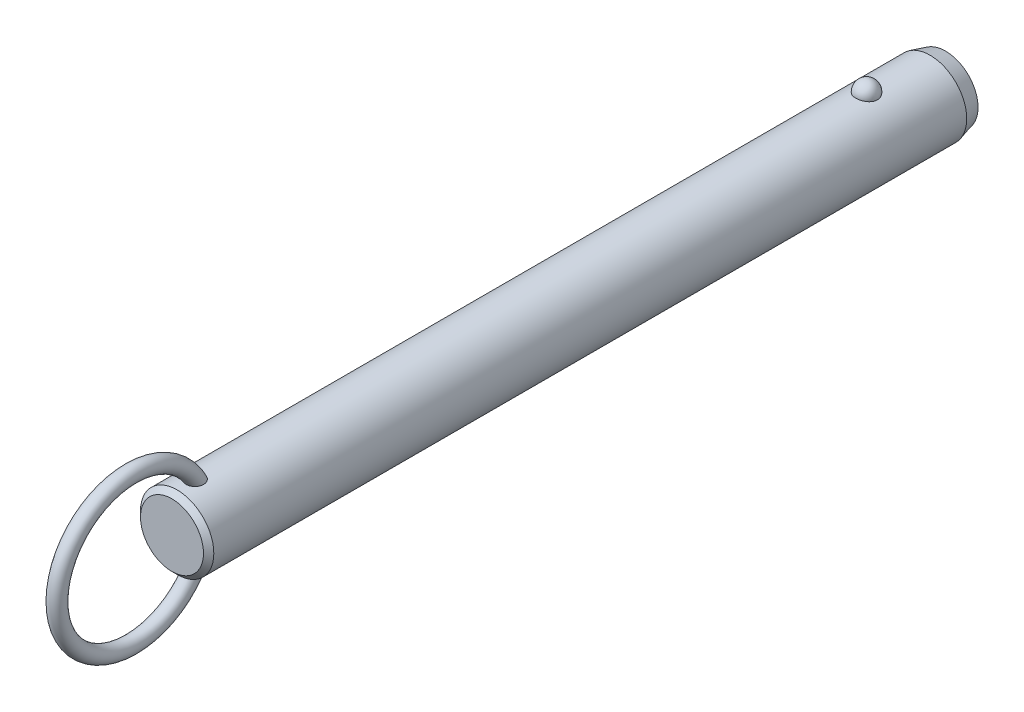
ISO-10303-21;
HEADER;
FILE_DESCRIPTION(('STEP AP214'),'2;1');
FILE_NAME('part.step','',(''),(''),'','','');
FILE_SCHEMA(('AUTOMOTIVE_DESIGN { 1 0 10303 214 1 1 1 1 }'));
ENDSEC;
DATA;
#1=APPLICATION_CONTEXT('core data for automotive mechanical design processes');
#2=APPLICATION_PROTOCOL_DEFINITION('international standard','automotive_design',2000,#1);
#3=PRODUCT_CONTEXT('',#1,'mechanical');
#4=PRODUCT('Part','Part','',(#3));
#5=PRODUCT_RELATED_PRODUCT_CATEGORY('part','',(#4));
#6=PRODUCT_DEFINITION_FORMATION('','',#4);
#7=PRODUCT_DEFINITION_CONTEXT('part definition',#1,'design');
#8=PRODUCT_DEFINITION('design','',#6,#7);
#9=PRODUCT_DEFINITION_SHAPE('','',#8);
#10=(LENGTH_UNIT() NAMED_UNIT(*) SI_UNIT(.MILLI.,.METRE.));
#11=(NAMED_UNIT(*) PLANE_ANGLE_UNIT() SI_UNIT($,.RADIAN.));
#12=(NAMED_UNIT(*) SI_UNIT($,.STERADIAN.) SOLID_ANGLE_UNIT());
#13=UNCERTAINTY_MEASURE_WITH_UNIT(LENGTH_MEASURE(1.E-05),#10,'distance_accuracy_value','');
#14=(GEOMETRIC_REPRESENTATION_CONTEXT(3) GLOBAL_UNCERTAINTY_ASSIGNED_CONTEXT((#13)) GLOBAL_UNIT_ASSIGNED_CONTEXT((#10,
#11,#12)) REPRESENTATION_CONTEXT('',''));
#15=CARTESIAN_POINT('',(0.,0.,0.));
#16=DIRECTION('',(0.,0.,1.));
#17=DIRECTION('',(1.,0.,0.));
#18=AXIS2_PLACEMENT_3D('',#15,#16,#17);
#19=CARTESIAN_POINT('',(0.,0.,124.5));
#20=DIRECTION('',(0.,0.,-1.));
#21=DIRECTION('',(-1.,0.,0.));
#22=AXIS2_PLACEMENT_3D('',#19,#20,#21);
#23=CYLINDRICAL_SURFACE('',#22,7.1);
#24=CARTESIAN_POINT('',(2.0769088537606,6.78943661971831,-2.1));
#25=CARTESIAN_POINT('',(2.07690739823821,6.78943796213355,-1.98268154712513));
#26=CARTESIAN_POINT('',(2.06738130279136,6.79237331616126,-1.86534506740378));
#27=CARTESIAN_POINT('',(2.0295040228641,6.8037853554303,-1.63400788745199));
#28=CARTESIAN_POINT('',(2.00114757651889,6.81226358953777,-1.52000812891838));
#29=CARTESIAN_POINT('',(1.92632025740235,6.83379798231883,-1.29863433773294));
#30=CARTESIAN_POINT('',(1.87985726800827,6.84685214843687,-1.19125744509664));
#31=CARTESIAN_POINT('',(1.76995205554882,6.87608091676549,-0.98604657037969));
#32=CARTESIAN_POINT('',(1.70650980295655,6.8922555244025,-0.88821260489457));
#33=CARTESIAN_POINT('',(1.5638119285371,6.92602930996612,-0.704242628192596));
#34=CARTESIAN_POINT('',(1.4844714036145,6.94363582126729,-0.618173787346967));
#35=CARTESIAN_POINT('',(1.31221746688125,6.97823658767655,-0.460740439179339));
#36=CARTESIAN_POINT('',(1.21930409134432,6.99523084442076,-0.389375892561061));
#37=CARTESIAN_POINT('',(1.02268781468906,7.02666176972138,-0.263547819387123));
#38=CARTESIAN_POINT('',(0.91902009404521,7.04110638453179,-0.209031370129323));
#39=CARTESIAN_POINT('',(0.703548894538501,7.06588726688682,-0.118163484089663));
#40=CARTESIAN_POINT('',(0.591746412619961,7.07622403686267,-0.0818098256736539));
#41=CARTESIAN_POINT('',(0.365557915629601,7.09147068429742,-0.0288711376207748));
#42=CARTESIAN_POINT('',(0.251267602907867,7.09648447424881,-0.0119070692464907));
#43=CARTESIAN_POINT('',(0.0213499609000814,7.10089837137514,0.00304925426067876));
#44=CARTESIAN_POINT('',(-0.0942772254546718,7.10029907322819,0.00104351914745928));
#45=CARTESIAN_POINT('',(-0.321651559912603,7.09360829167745,-0.0216931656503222));
#46=CARTESIAN_POINT('',(-0.433431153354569,7.08760388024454,-0.0421272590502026));
#47=CARTESIAN_POINT('',(-0.651862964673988,7.07086131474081,-0.100729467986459));
#48=CARTESIAN_POINT('',(-0.758515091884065,7.06012307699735,-0.138897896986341));
#49=CARTESIAN_POINT('',(-0.964449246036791,7.03496097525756,-0.232213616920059));
#50=CARTESIAN_POINT('',(-1.06368095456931,7.02051445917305,-0.287465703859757));
#51=CARTESIAN_POINT('',(-1.25145353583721,6.98948740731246,-0.413383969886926));
#52=CARTESIAN_POINT('',(-1.33999321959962,6.97290663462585,-0.48405186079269));
#53=CARTESIAN_POINT('',(-1.50591604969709,6.93898770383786,-0.640594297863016));
#54=CARTESIAN_POINT('',(-1.58302488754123,6.92164094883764,-0.726757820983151));
#55=CARTESIAN_POINT('',(-1.72189320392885,6.8884103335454,-0.91092752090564));
#56=CARTESIAN_POINT('',(-1.78365144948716,6.87252659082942,-1.008934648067));
#57=CARTESIAN_POINT('',(-1.89101272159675,6.84377189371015,-1.21549497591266));
#58=CARTESIAN_POINT('',(-1.93639553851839,6.83094274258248,-1.32416860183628));
#59=CARTESIAN_POINT('',(-2.00874275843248,6.81002070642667,-1.54791500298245));
#60=CARTESIAN_POINT('',(-2.03570774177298,6.80192767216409,-1.66298757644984));
#61=CARTESIAN_POINT('',(-2.07047276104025,6.7914266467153,-1.89571453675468));
#62=CARTESIAN_POINT('',(-2.07835878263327,6.78899315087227,-2.01335491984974));
#63=CARTESIAN_POINT('',(-2.07502083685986,6.79001409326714,-2.24833570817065));
#64=CARTESIAN_POINT('',(-2.06379746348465,6.7934683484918,-2.36567612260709));
#65=CARTESIAN_POINT('',(-2.02263913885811,6.80583442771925,-2.59603194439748));
#66=CARTESIAN_POINT('',(-1.99281127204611,6.81471501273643,-2.70906820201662));
#67=CARTESIAN_POINT('',(-1.91526639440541,6.83691232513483,-2.92836575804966));
#68=CARTESIAN_POINT('',(-1.8675486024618,6.85022924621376,-3.03462676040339));
#69=CARTESIAN_POINT('',(-1.75504492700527,6.87991336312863,-3.23806487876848));
#70=CARTESIAN_POINT('',(-1.69015924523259,6.89629822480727,-3.33518422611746));
#71=CARTESIAN_POINT('',(-1.54505404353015,6.93024852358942,-3.51697105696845));
#72=CARTESIAN_POINT('',(-1.46483385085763,6.94781401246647,-3.60163799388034));
#73=CARTESIAN_POINT('',(-1.29071406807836,6.98225977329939,-3.75654119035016));
#74=CARTESIAN_POINT('',(-1.19675650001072,6.99913673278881,-3.82671308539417));
#75=CARTESIAN_POINT('',(-0.997940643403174,7.03023618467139,-3.9501837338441));
#76=CARTESIAN_POINT('',(-0.89308318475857,7.04445887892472,-4.00348377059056));
#77=CARTESIAN_POINT('',(-0.676902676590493,7.06848365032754,-4.09107242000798));
#78=CARTESIAN_POINT('',(-0.565686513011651,7.0783430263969,-4.12560889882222));
#79=CARTESIAN_POINT('',(-0.338739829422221,7.09282534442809,-4.17575450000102));
#80=CARTESIAN_POINT('',(-0.223009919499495,7.09744899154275,-4.19136617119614));
#81=CARTESIAN_POINT('',(0.00707628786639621,7.10090930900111,-4.20307965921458));
#82=CARTESIAN_POINT('',(0.121410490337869,7.09986531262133,-4.19958377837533));
#83=CARTESIAN_POINT('',(0.347815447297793,7.092380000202,-4.17411564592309));
#84=CARTESIAN_POINT('',(0.459886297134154,7.08593891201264,-4.15214417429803));
#85=CARTESIAN_POINT('',(0.678084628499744,7.06838983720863,-4.09049562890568));
#86=CARTESIAN_POINT('',(0.784237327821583,7.05730369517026,-4.05090137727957));
#87=CARTESIAN_POINT('',(0.988305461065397,7.03163139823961,-3.95511447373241));
#88=CARTESIAN_POINT('',(1.08622031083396,7.01704499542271,-3.89892064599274));
#89=CARTESIAN_POINT('',(1.27284490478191,6.98562668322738,-3.77035541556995));
#90=CARTESIAN_POINT('',(1.36137372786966,6.96876135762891,-3.69772964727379));
#91=CARTESIAN_POINT('',(1.52509486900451,6.93477412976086,-3.53878279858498));
#92=CARTESIAN_POINT('',(1.60028496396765,6.91765218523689,-3.45245943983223));
#93=CARTESIAN_POINT('',(1.73681688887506,6.88465753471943,-3.26658774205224));
#94=CARTESIAN_POINT('',(1.79785966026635,6.86881574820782,-3.16681408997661));
#95=CARTESIAN_POINT('',(1.90265327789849,6.84053157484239,-2.95814408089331));
#96=CARTESIAN_POINT('',(1.94640861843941,6.82808830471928,-2.84925010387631));
#97=CARTESIAN_POINT('',(2.01274378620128,6.80881460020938,-2.63454318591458));
#98=CARTESIAN_POINT('',(2.03676193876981,6.80160856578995,-2.52920574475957));
#99=CARTESIAN_POINT('',(2.06884490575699,6.79191902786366,-2.3159172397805));
#100=CARTESIAN_POINT('',(2.07691019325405,6.78943538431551,-2.20796625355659));
#101=CARTESIAN_POINT('',(2.0769088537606,6.78943661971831,-2.1));
#102=B_SPLINE_CURVE_WITH_KNOTS('',3,(#24,#25,#26,#27,#28,#29,#30,#31,#32,#33,#34,#35,#36,#37,
#38,#39,#40,#41,#42,#43,#44,#45,#46,#47,#48,#49,#50,#51,#52,#53,#54,#55,#56,#57,#58,#59,#60,#61,
#62,#63,#64,#65,#66,#67,#68,#69,#70,#71,#72,#73,#74,#75,#76,#77,#78,#79,#80,#81,#82,#83,#84,#85,
#86,#87,#88,#89,#90,#91,#92,#93,#94,#95,#96,#97,#98,#99,#100,#101),.UNSPECIFIED.,.T.,.F.,(4,2,2,
2,2,2,2,2,2,2,2,2,2,2,2,2,2,2,2,2,2,2,2,2,2,2,2,2,2,2,2,2,2,2,2,2,2,2,4),(0.,0.351568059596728,
0.703234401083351,1.05474780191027,1.40626181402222,1.75970563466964,2.11314851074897,
2.4654696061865,2.81774759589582,3.16301449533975,3.50824481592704,3.84801136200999,
4.18778391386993,4.52968352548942,4.87162112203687,5.22076181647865,5.56993054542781,
5.92363364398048,6.27732559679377,6.62942052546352,6.98150450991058,7.33158042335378,
7.68167162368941,8.03384443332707,8.38603269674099,8.73975272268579,9.09344583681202,
9.44234545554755,9.79119807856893,10.1327344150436,10.4742563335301,10.8141898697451,
11.1541474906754,11.4997793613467,11.8454687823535,12.1979079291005,12.5502553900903,
12.8738073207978,13.1973496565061),.UNSPECIFIED.);
#103=CARTESIAN_POINT('',(2.0769088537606,6.78943661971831,-2.1));
#104=VERTEX_POINT('',#103);
#105=EDGE_CURVE('E41',#104,#104,#102,.T.);
#106=ORIENTED_EDGE('',*,*,#105,.T.);
#107=EDGE_LOOP('',(#106));
#108=FACE_BOUND('',#107,.T.);
#109=CARTESIAN_POINT('',(0.,0.,131.42));
#110=DIRECTION('',(0.,0.,1.));
#111=DIRECTION('',(1.,0.,0.));
#112=AXIS2_PLACEMENT_3D('',#109,#110,#111);
#113=CIRCLE('',#112,7.1);
#114=CARTESIAN_POINT('',(7.1,0.,131.42));
#115=VERTEX_POINT('',#114);
#116=EDGE_CURVE('E10',#115,#115,#113,.F.);
#117=ORIENTED_EDGE('',*,*,#116,.T.);
#118=EDGE_LOOP('',(#117));
#119=FACE_BOUND('',#118,.T.);
#120=CARTESIAN_POINT('',(-0.429539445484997,-7.08699541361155,126.242921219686));
#121=CARTESIAN_POINT('',(-0.508331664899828,-7.08221999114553,126.266876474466));
#122=CARTESIAN_POINT('',(-0.585039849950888,-7.07624016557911,126.297457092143));
#123=CARTESIAN_POINT('',(-0.73208265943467,-7.06254296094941,126.371024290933));
#124=CARTESIAN_POINT('',(-0.802417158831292,-7.05482554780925,126.414011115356));
#125=CARTESIAN_POINT('',(-0.934722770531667,-7.03851844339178,126.511113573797));
#126=CARTESIAN_POINT('',(-0.996700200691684,-7.02992941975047,126.565220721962));
#127=CARTESIAN_POINT('',(-1.11079942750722,-7.01280697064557,126.682967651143));
#128=CARTESIAN_POINT('',(-1.16292136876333,-7.00427354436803,126.746607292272));
#129=CARTESIAN_POINT('',(-1.25705660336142,-6.98799959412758,126.882687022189));
#130=CARTESIAN_POINT('',(-1.29888032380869,-6.98027525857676,126.955259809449));
#131=CARTESIAN_POINT('',(-1.37069920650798,-6.96652886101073,127.106168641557));
#132=CARTESIAN_POINT('',(-1.40069157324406,-6.96050720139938,127.184506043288));
#133=CARTESIAN_POINT('',(-1.45043507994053,-6.95031881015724,127.350190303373));
#134=CARTESIAN_POINT('',(-1.46937115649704,-6.94630231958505,127.437789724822));
#135=CARTESIAN_POINT('',(-1.49424917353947,-6.94099239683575,127.614871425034));
#136=CARTESIAN_POINT('',(-1.50018601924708,-6.93970003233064,127.704354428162));
#137=CARTESIAN_POINT('',(-1.49978214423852,-6.93978815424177,127.894060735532));
#138=CARTESIAN_POINT('',(-1.49187639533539,-6.94150934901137,127.994279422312));
#139=CARTESIAN_POINT('',(-1.46177925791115,-6.94790814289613,128.192479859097));
#140=CARTESIAN_POINT('',(-1.43957541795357,-6.95258831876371,128.290459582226));
#141=CARTESIAN_POINT('',(-1.37783293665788,-6.96510647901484,128.49536292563));
#142=CARTESIAN_POINT('',(-1.33634073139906,-6.97328848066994,128.601680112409));
#143=CARTESIAN_POINT('',(-1.23686994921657,-6.99161706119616,128.806177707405));
#144=CARTESIAN_POINT('',(-1.17889192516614,-7.00176357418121,128.904358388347));
#145=CARTESIAN_POINT('',(-1.05875124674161,-7.02082898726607,129.072374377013));
#146=CARTESIAN_POINT('',(-0.999247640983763,-7.02963746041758,129.144123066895));
#147=CARTESIAN_POINT('',(-0.869494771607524,-7.04686074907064,129.277195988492));
#148=CARTESIAN_POINT('',(-0.799263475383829,-7.05527619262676,129.338537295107));
#149=CARTESIAN_POINT('',(-0.665408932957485,-7.06899457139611,129.435131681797));
#150=CARTESIAN_POINT('',(-0.603817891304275,-7.07457275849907,129.473151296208));
#151=CARTESIAN_POINT('',(-0.475172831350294,-7.08437420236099,129.538758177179));
#152=CARTESIAN_POINT('',(-0.4081230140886,-7.08859848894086,129.566353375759));
#153=CARTESIAN_POINT('',(-0.26943193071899,-7.09522749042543,129.609256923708));
#154=CARTESIAN_POINT('',(-0.197757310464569,-7.09761688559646,129.624461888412));
#155=CARTESIAN_POINT('',(-0.05278498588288,-7.10017268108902,129.640716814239));
#156=CARTESIAN_POINT('',(0.020511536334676,-7.10034065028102,129.641776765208));
#157=CARTESIAN_POINT('',(0.156426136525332,-7.09855986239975,129.630461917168));
#158=CARTESIAN_POINT('',(0.219199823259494,-7.09688191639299,129.619806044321));
#159=CARTESIAN_POINT('',(0.342134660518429,-7.09201880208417,129.588537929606));
#160=CARTESIAN_POINT('',(0.402295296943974,-7.08883333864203,129.567923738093));
#161=CARTESIAN_POINT('',(0.520687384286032,-7.08113868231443,129.517212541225));
#162=CARTESIAN_POINT('',(0.578791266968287,-7.07658958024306,129.486827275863));
#163=CARTESIAN_POINT('',(0.69017323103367,-7.06659708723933,129.418367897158));
#164=CARTESIAN_POINT('',(0.743447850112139,-7.061153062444,129.380288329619));
#165=CARTESIAN_POINT('',(0.87094790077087,-7.04680292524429,129.276592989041));
#166=CARTESIAN_POINT('',(0.941828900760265,-7.03755800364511,129.206897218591));
#167=CARTESIAN_POINT('',(1.07136606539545,-7.01900793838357,129.056945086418));
#168=CARTESIAN_POINT('',(1.13000013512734,-7.00970271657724,128.976670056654));
#169=CARTESIAN_POINT('',(1.23579584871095,-6.99183327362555,128.806899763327));
#170=CARTESIAN_POINT('',(1.28274271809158,-6.98328455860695,128.717269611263));
#171=CARTESIAN_POINT('',(1.3635144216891,-6.96796352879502,128.532176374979));
#172=CARTESIAN_POINT('',(1.39733971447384,-6.96119115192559,128.436713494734));
#173=CARTESIAN_POINT('',(1.45579181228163,-6.94922464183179,128.22530928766));
#174=CARTESIAN_POINT('',(1.47790145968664,-6.94449000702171,128.108631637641));
#175=CARTESIAN_POINT('',(1.50168752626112,-6.93938731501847,127.873015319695));
#176=CARTESIAN_POINT('',(1.50336085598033,-6.93901991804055,127.75407631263));
#177=CARTESIAN_POINT('',(1.48486516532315,-6.9430010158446,127.52360799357));
#178=CARTESIAN_POINT('',(1.46573441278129,-6.9471253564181,127.411995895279));
#179=CARTESIAN_POINT('',(1.40606892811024,-6.95944667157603,127.194886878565));
#180=CARTESIAN_POINT('',(1.36556446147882,-6.96763788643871,127.0893815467));
#181=CARTESIAN_POINT('',(1.2708270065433,-6.98548038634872,126.904287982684));
#182=CARTESIAN_POINT('',(1.21949810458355,-6.99473841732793,126.823171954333));
#183=CARTESIAN_POINT('',(1.10242050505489,-7.0141406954,126.672227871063));
#184=CARTESIAN_POINT('',(1.03668119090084,-7.02428436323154,126.60239252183));
#185=CARTESIAN_POINT('',(0.900559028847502,-7.04295285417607,126.483573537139));
#186=CARTESIAN_POINT('',(0.831428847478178,-7.05153466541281,126.433157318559));
#187=CARTESIAN_POINT('',(0.685291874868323,-7.06723150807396,126.345142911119));
#188=CARTESIAN_POINT('',(0.608287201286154,-7.07434693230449,126.307541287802));
#189=CARTESIAN_POINT('',(0.451878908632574,-7.08602232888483,126.247491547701));
#190=CARTESIAN_POINT('',(0.372686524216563,-7.09067127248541,126.224508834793));
#191=CARTESIAN_POINT('',(0.211477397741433,-7.09730788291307,126.192035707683));
#192=CARTESIAN_POINT('',(0.129460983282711,-7.09929585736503,126.18254373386));
#193=CARTESIAN_POINT('',(-0.0332905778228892,-7.10037858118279,126.177351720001));
#194=CARTESIAN_POINT('',(-0.114016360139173,-7.09953334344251,126.181365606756));
#195=CARTESIAN_POINT('',(-0.27367033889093,-7.09517338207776,126.202454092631));
#196=CARTESIAN_POINT('',(-0.352598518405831,-7.09165863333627,126.219528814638));
#197=CARTESIAN_POINT('',(-0.429539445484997,-7.08699541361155,126.242921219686));
#198=B_SPLINE_CURVE_WITH_KNOTS('',3,(#120,#121,#122,#123,#124,#125,#126,#127,#128,#129,#130,
#131,#132,#133,#134,#135,#136,#137,#138,#139,#140,#141,#142,#143,#144,#145,#146,#147,#148,#149,
#150,#151,#152,#153,#154,#155,#156,#157,#158,#159,#160,#161,#162,#163,#164,#165,#166,#167,#168,
#169,#170,#171,#172,#173,#174,#175,#176,#177,#178,#179,#180,#181,#182,#183,#184,#185,#186,#187,
#188,#189,#190,#191,#192,#193,#194,#195,#196,#197),.UNSPECIFIED.,.T.,.F.,(4,2,2,2,2,2,2,2,2,2,2,
2,2,2,2,2,2,2,2,2,2,2,2,2,2,2,2,2,2,2,2,2,2,2,2,2,2,2,4),(0.,0.247183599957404,
0.494372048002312,0.741372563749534,0.988369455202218,1.23962059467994,1.490931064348,
1.75897818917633,2.02713035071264,2.3275826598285,2.62829697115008,2.97008736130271,
3.31186629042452,3.59175319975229,3.87117637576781,4.08813841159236,4.30493502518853,
4.5235225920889,4.74195577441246,4.93215328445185,5.12238804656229,5.318848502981,
5.51544871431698,5.81332317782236,6.11173048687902,6.41527266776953,6.71880423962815,
7.07358156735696,7.42841252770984,7.76631485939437,8.10373999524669,8.39142246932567,
8.67891817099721,8.93560332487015,9.19221962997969,9.43881106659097,9.68537399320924,
9.92674752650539,10.1681233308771),.UNSPECIFIED.);
#199=CARTESIAN_POINT('',(-0.429539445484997,-7.08699541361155,126.242921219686));
#200=VERTEX_POINT('',#199);
#201=EDGE_CURVE('E60',#200,#200,#198,.T.);
#202=ORIENTED_EDGE('',*,*,#201,.T.);
#203=EDGE_LOOP('',(#202));
#204=FACE_BOUND('',#203,.T.);
#205=CARTESIAN_POINT('',(-0.429539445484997,7.08699541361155,126.242921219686));
#206=CARTESIAN_POINT('',(-0.351665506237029,7.09171429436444,126.219246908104));
#207=CARTESIAN_POINT('',(-0.271733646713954,7.09525896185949,126.202036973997));
#208=CARTESIAN_POINT('',(-0.110026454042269,7.09960839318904,126.181005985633));
#209=CARTESIAN_POINT('',(-0.0282502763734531,7.10041187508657,126.177191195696));
#210=CARTESIAN_POINT('',(0.134782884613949,7.09918849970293,126.183059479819));
#211=CARTESIAN_POINT('',(0.216039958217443,7.09716214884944,126.19274013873));
#212=CARTESIAN_POINT('',(0.375730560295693,7.09050177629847,126.225347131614));
#213=CARTESIAN_POINT('',(0.454164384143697,7.08586802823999,126.248272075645));
#214=CARTESIAN_POINT('',(0.606025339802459,7.07449911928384,126.306771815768));
#215=CARTESIAN_POINT('',(0.679451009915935,7.06776334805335,126.342350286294));
#216=CARTESIAN_POINT('',(0.81923414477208,7.05292866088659,126.425175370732));
#217=CARTESIAN_POINT('',(0.885591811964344,7.04482978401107,126.472421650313));
#218=CARTESIAN_POINT('',(1.00993211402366,7.02808709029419,126.577590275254));
#219=CARTESIAN_POINT('',(1.06785399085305,7.01943990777,126.635583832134));
#220=CARTESIAN_POINT('',(1.17342527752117,7.00256662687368,126.760301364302));
#221=CARTESIAN_POINT('',(1.22107408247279,6.99434055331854,126.827025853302));
#222=CARTESIAN_POINT('',(1.30652927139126,6.97889183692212,126.969362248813));
#223=CARTESIAN_POINT('',(1.34399711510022,6.97170674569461,127.045180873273));
#224=CARTESIAN_POINT('',(1.40682616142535,6.95930080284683,127.201810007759));
#225=CARTESIAN_POINT('',(1.43218374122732,6.95408053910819,127.28262200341));
#226=CARTESIAN_POINT('',(1.47246409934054,6.94566853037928,127.453531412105));
#227=CARTESIAN_POINT('',(1.48642590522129,6.9426653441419,127.54386307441));
#228=CARTESIAN_POINT('',(1.5011410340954,6.93949744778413,127.725619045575));
#229=CARTESIAN_POINT('',(1.50188917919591,6.93933385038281,127.817043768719));
#230=CARTESIAN_POINT('',(1.49030464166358,6.94183245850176,128.01084381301));
#231=CARTESIAN_POINT('',(1.47627413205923,6.94486147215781,128.113112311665));
#232=CARTESIAN_POINT('',(1.43356351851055,6.95380194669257,128.314471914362));
#233=CARTESIAN_POINT('',(1.4048676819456,6.95971650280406,128.413559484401));
#234=CARTESIAN_POINT('',(1.32908750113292,6.97461208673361,128.618908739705));
#235=CARTESIAN_POINT('',(1.28011435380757,6.98388945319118,128.724456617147));
#236=CARTESIAN_POINT('',(1.16520357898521,7.00397743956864,128.925760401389));
#237=CARTESIAN_POINT('',(1.09927694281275,7.01478706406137,129.021522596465));
#238=CARTESIAN_POINT('',(0.969361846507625,7.03373936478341,129.176756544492));
#239=CARTESIAN_POINT('',(0.909042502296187,7.04187023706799,129.239303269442));
#240=CARTESIAN_POINT('',(0.779178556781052,7.05741732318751,129.354053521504));
#241=CARTESIAN_POINT('',(0.709649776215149,7.06483472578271,129.406274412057));
#242=CARTESIAN_POINT('',(0.576854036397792,7.0767751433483,129.488113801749));
#243=CARTESIAN_POINT('',(0.515118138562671,7.08158033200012,129.520164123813));
#244=CARTESIAN_POINT('',(0.387127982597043,7.08972701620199,129.573765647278));
#245=CARTESIAN_POINT('',(0.320877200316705,7.09306962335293,129.595324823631));
#246=CARTESIAN_POINT('',(0.185041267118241,7.09791507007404,129.626400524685));
#247=CARTESIAN_POINT('',(0.115437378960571,7.09940591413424,129.63583854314));
#248=CARTESIAN_POINT('',(-0.024315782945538,7.10030171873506,129.641522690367));
#249=CARTESIAN_POINT('',(-0.0944648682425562,7.0997073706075,129.637773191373));
#250=CARTESIAN_POINT('',(-0.225713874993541,7.09668414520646,129.618508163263));
#251=CARTESIAN_POINT('',(-0.287006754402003,7.09444865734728,129.604232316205));
#252=CARTESIAN_POINT('',(-0.406555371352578,7.08860360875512,129.566368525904));
#253=CARTESIAN_POINT('',(-0.464809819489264,7.08499346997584,129.542776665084));
#254=CARTESIAN_POINT('',(-0.594955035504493,7.07541654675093,129.478923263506));
#255=CARTESIAN_POINT('',(-0.665389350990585,7.06906574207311,129.435753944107));
#256=CARTESIAN_POINT('',(-0.798242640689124,7.05530261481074,129.338587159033));
#257=CARTESIAN_POINT('',(-0.860645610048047,7.0478882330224,129.284568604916));
#258=CARTESIAN_POINT('',(-0.994249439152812,7.03045217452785,129.150996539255));
#259=CARTESIAN_POINT('',(-1.06260129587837,7.02030745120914,129.068614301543));
#260=CARTESIAN_POINT('',(-1.18502045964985,7.00068382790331,128.893843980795));
#261=CARTESIAN_POINT('',(-1.23907684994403,6.99120544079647,128.801448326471));
#262=CARTESIAN_POINT('',(-1.33335589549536,6.97384343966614,128.608008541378));
#263=CARTESIAN_POINT('',(-1.37336138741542,6.96598557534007,128.506856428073));
#264=CARTESIAN_POINT('',(-1.43770677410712,6.95299053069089,128.299504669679));
#265=CARTESIAN_POINT('',(-1.46204473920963,6.94785368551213,128.19330440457));
#266=CARTESIAN_POINT('',(-1.49537533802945,6.94076296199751,127.968231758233));
#267=CARTESIAN_POINT('',(-1.50273564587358,6.93914842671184,127.84909751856));
#268=CARTESIAN_POINT('',(-1.4954555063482,6.94072368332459,127.611470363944));
#269=CARTESIAN_POINT('',(-1.48082914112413,6.94391040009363,127.492977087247));
#270=CARTESIAN_POINT('',(-1.43076401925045,6.95438579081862,127.273432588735));
#271=CARTESIAN_POINT('',(-1.39762227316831,6.96121852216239,127.171841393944));
#272=CARTESIAN_POINT('',(-1.31211274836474,6.97783941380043,126.977351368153));
#273=CARTESIAN_POINT('',(-1.25976607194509,6.98762432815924,126.88444313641));
#274=CARTESIAN_POINT('',(-1.14583073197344,7.00713153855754,126.724160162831));
#275=CARTESIAN_POINT('',(-1.08665947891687,7.01665982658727,126.655035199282));
#276=CARTESIAN_POINT('',(-0.95660664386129,7.03556646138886,126.528878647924));
#277=CARTESIAN_POINT('',(-0.885737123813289,7.04494495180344,126.471834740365));
#278=CARTESIAN_POINT('',(-0.751558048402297,7.06035735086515,126.383100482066));
#279=CARTESIAN_POINT('',(-0.690120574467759,7.0666695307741,126.348593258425));
#280=CARTESIAN_POINT('',(-0.562815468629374,7.07794609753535,126.288750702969));
#281=CARTESIAN_POINT('',(-0.496948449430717,7.08291067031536,126.263414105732));
#282=CARTESIAN_POINT('',(-0.429539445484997,7.08699541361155,126.242921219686));
#283=B_SPLINE_CURVE_WITH_KNOTS('',3,(#205,#206,#207,#208,#209,#210,#211,#212,#213,#214,#215,
#216,#217,#218,#219,#220,#221,#222,#223,#224,#225,#226,#227,#228,#229,#230,#231,#232,#233,#234,
#235,#236,#237,#238,#239,#240,#241,#242,#243,#244,#245,#246,#247,#248,#249,#250,#251,#252,#253,
#254,#255,#256,#257,#258,#259,#260,#261,#262,#263,#264,#265,#266,#267,#268,#269,#270,#271,#272,
#273,#274,#275,#276,#277,#278,#279,#280,#281,#282),.UNSPECIFIED.,.T.,.F.,(4,2,2,2,2,2,2,2,2,2,2,
2,2,2,2,2,2,2,2,2,2,2,2,2,2,2,2,2,2,2,2,2,2,2,2,2,2,2,4),(0.,0.244335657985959,
0.488785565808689,0.733191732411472,0.977572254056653,1.22202379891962,1.46646834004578,
1.71259457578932,1.9587352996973,2.21226768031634,2.46587585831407,2.73913816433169,
3.01250754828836,3.32109936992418,3.63002293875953,3.9786351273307,4.32702187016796,
4.58793945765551,4.84841449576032,5.05676704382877,5.26496096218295,5.47449661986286,
5.68396281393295,5.87205447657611,6.06022532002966,6.30743751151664,6.55513496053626,
6.87602468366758,7.19715875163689,7.5230577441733,7.84899686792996,8.20516155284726,
8.56109821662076,8.88040084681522,9.19935367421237,9.47236282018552,9.74509220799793,
9.95662250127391,10.1681235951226),.UNSPECIFIED.);
#284=CARTESIAN_POINT('',(-0.429539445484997,7.08699541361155,126.242921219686));
#285=VERTEX_POINT('',#284);
#286=EDGE_CURVE('E68',#285,#285,#283,.T.);
#287=ORIENTED_EDGE('',*,*,#286,.T.);
#288=EDGE_LOOP('',(#287));
#289=FACE_BOUND('',#288,.T.);
#290=CARTESIAN_POINT('',(0.,0.,-14.4));
#291=DIRECTION('',(0.,0.,-1.));
#292=DIRECTION('',(-1.,0.,0.));
#293=AXIS2_PLACEMENT_3D('',#290,#291,#292);
#294=CIRCLE('',#293,7.1);
#295=CARTESIAN_POINT('',(-7.1,0.,-14.4));
#296=VERTEX_POINT('',#295);
#297=EDGE_CURVE('E57',#296,#296,#294,.F.);
#298=ORIENTED_EDGE('',*,*,#297,.T.);
#299=EDGE_LOOP('',(#298));
#300=FACE_BOUND('',#299,.T.);
#301=ADVANCED_FACE('F37',(#108,#119,#204,#289,#300),#23,.T.);
#302=CARTESIAN_POINT('',(0.,0.,-17.4));
#303=DIRECTION('',(0.,0.,-1.));
#304=DIRECTION('',(-1.,0.,0.));
#305=AXIS2_PLACEMENT_3D('',#302,#303,#304);
#306=PLANE('',#305);
#307=CARTESIAN_POINT('',(0.,0.,-17.4));
#308=DIRECTION('',(0.,0.,-1.));
#309=DIRECTION('',(-1.,0.,0.));
#310=AXIS2_PLACEMENT_3D('',#307,#308,#309);
#311=CIRCLE('',#310,6.29615242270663);
#312=CARTESIAN_POINT('',(-6.29615242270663,0.,-17.4));
#313=VERTEX_POINT('',#312);
#314=EDGE_CURVE('E67',#313,#313,#311,.T.);
#315=ORIENTED_EDGE('',*,*,#314,.T.);
#316=EDGE_LOOP('',(#315));
#317=FACE_BOUND('',#316,.T.);
#318=ADVANCED_FACE('F86',(#317),#306,.T.);
#319=CARTESIAN_POINT('',(0.,0.,-17.4));
#320=DIRECTION('',(0.,0.,1.));
#321=DIRECTION('',(1.,0.,0.));
#322=AXIS2_PLACEMENT_3D('',#319,#320,#321);
#323=CONICAL_SURFACE('',#322,6.29615242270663,0.261799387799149);
#324=ORIENTED_EDGE('',*,*,#297,.F.);
#325=EDGE_LOOP('',(#324));
#326=FACE_BOUND('',#325,.T.);
#327=ORIENTED_EDGE('',*,*,#314,.F.);
#328=EDGE_LOOP('',(#327));
#329=FACE_BOUND('',#328,.T.);
#330=ADVANCED_FACE('F84',(#326,#329),#323,.T.);
#331=CARTESIAN_POINT('',(0.,0.,132.42));
#332=DIRECTION('',(0.,0.,1.));
#333=DIRECTION('',(1.,0.,0.));
#334=AXIS2_PLACEMENT_3D('',#331,#332,#333);
#335=PLANE('',#334);
#336=CARTESIAN_POINT('',(0.,0.,132.42));
#337=DIRECTION('',(0.,0.,1.));
#338=DIRECTION('',(1.,0.,0.));
#339=AXIS2_PLACEMENT_3D('',#336,#337,#338);
#340=CIRCLE('',#339,6.09999999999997);
#341=CARTESIAN_POINT('',(6.09999999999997,0.,132.42));
#342=VERTEX_POINT('',#341);
#343=EDGE_CURVE('E50',#342,#342,#340,.T.);
#344=ORIENTED_EDGE('',*,*,#343,.T.);
#345=EDGE_LOOP('',(#344));
#346=FACE_BOUND('',#345,.T.);
#347=ADVANCED_FACE('F78',(#346),#335,.T.);
#348=CARTESIAN_POINT('',(0.,0.,140.35));
#349=DIRECTION('',(1.,0.,0.));
#350=DIRECTION('',(0.,0.,-1.));
#351=AXIS2_PLACEMENT_3D('',#348,#349,#350);
#352=TOROIDAL_SURFACE('',#351,14.35,1.5);
#353=ORIENTED_EDGE('',*,*,#286,.F.);
#354=EDGE_LOOP('',(#353));
#355=FACE_BOUND('',#354,.T.);
#356=ORIENTED_EDGE('',*,*,#201,.F.);
#357=EDGE_LOOP('',(#356));
#358=FACE_BOUND('',#357,.T.);
#359=ADVANCED_FACE('F74',(#355,#358),#352,.T.);
#360=CARTESIAN_POINT('',(0.,0.,132.42));
#361=DIRECTION('',(0.,0.,-1.));
#362=DIRECTION('',(-1.,0.,0.));
#363=AXIS2_PLACEMENT_3D('',#360,#361,#362);
#364=CONICAL_SURFACE('',#363,6.09999999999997,0.78539816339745);
#365=ORIENTED_EDGE('',*,*,#116,.F.);
#366=EDGE_LOOP('',(#365));
#367=FACE_BOUND('',#366,.T.);
#368=ORIENTED_EDGE('',*,*,#343,.F.);
#369=EDGE_LOOP('',(#368));
#370=FACE_BOUND('',#369,.T.);
#371=ADVANCED_FACE('F39',(#367,#370),#364,.T.);
#372=CARTESIAN_POINT('',(0.,7.1,-2.1));
#373=DIRECTION('',(0.,1.,0.));
#374=DIRECTION('',(0.,0.,1.));
#375=AXIS2_PLACEMENT_3D('',#372,#373,#374);
#376=SPHERICAL_SURFACE('',#375,2.10000000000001);
#377=ORIENTED_EDGE('',*,*,#105,.F.);
#378=EDGE_LOOP('',(#377));
#379=FACE_BOUND('',#378,.T.);
#380=ADVANCED_FACE('F80',(#379),#376,.T.);
#381=CLOSED_SHELL('',(#301,#318,#330,#347,#359,#371,#380));
#382=MANIFOLD_SOLID_BREP('B2',#381);
#383=ADVANCED_BREP_SHAPE_REPRESENTATION('',(#18,#382),#14);
#384=SHAPE_DEFINITION_REPRESENTATION(#9,#383);
ENDSEC;
END-ISO-10303-21;
